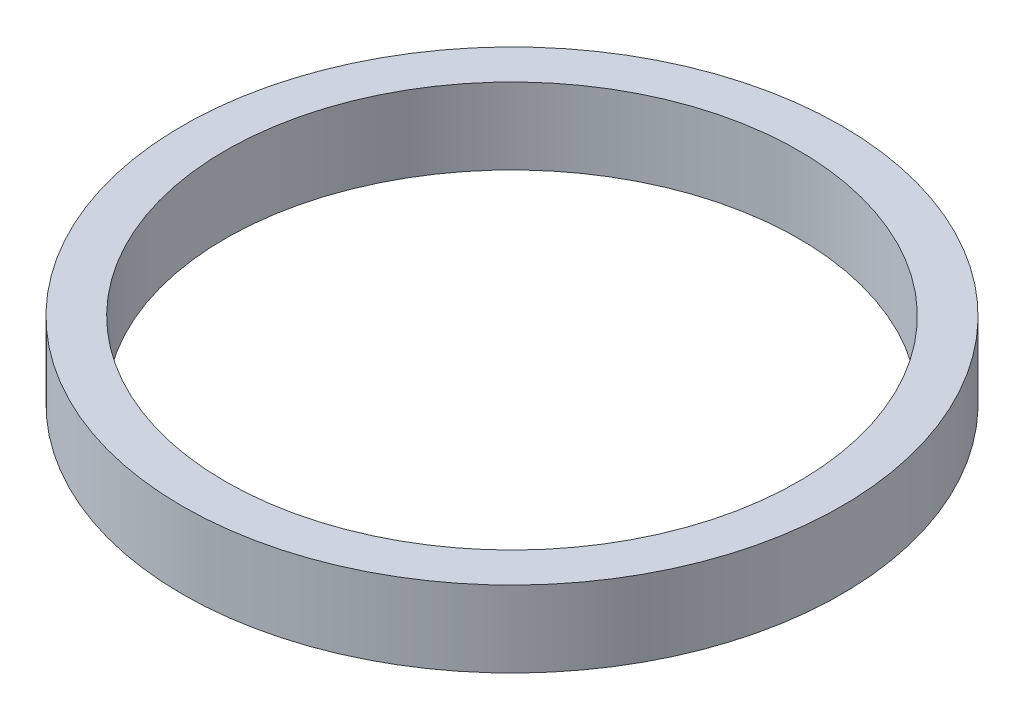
from build123d import *

# Parameters (mm, degrees)
SKETCH1_R           = 129.784214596
SKETCH1_R_2         = 112.883971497
BOSS_EXTRUDE1_DEPTH = 30


with BuildPart() as part:
    # Sketch1 → Boss-Extrude1 (new body)
    with BuildSketch(Plane(origin=(0, 0, 0), x_dir=(1, 0, 0), z_dir=(0, 1, 0))):
        with Locations(Location((-234.756237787, 468.327794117, 0), (0, 0, 270))):
            Circle(SKETCH1_R)
        with Locations(Location((-234.756237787, 468.327794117, 0), (0, 0, 270))):
            Circle(SKETCH1_R_2, mode=Mode.SUBTRACT)
    extrude(amount=BOSS_EXTRUDE1_DEPTH)


solid = part.part
